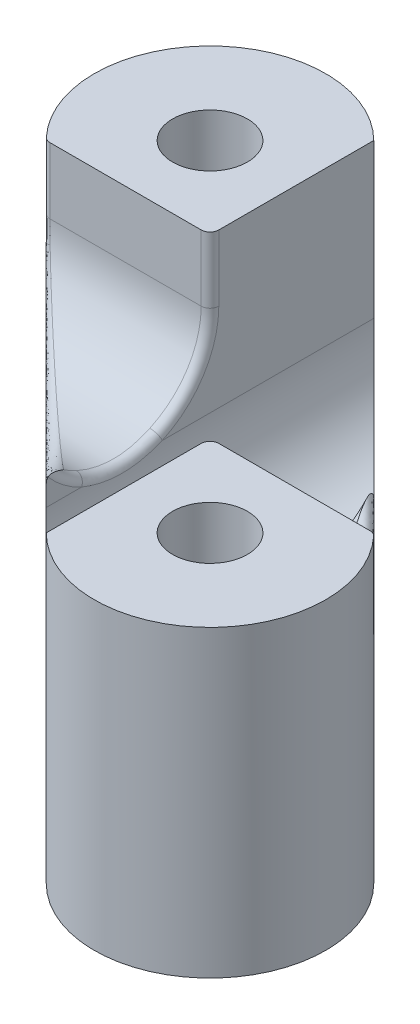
from build123d import *

# Parameters (mm, degrees)
SKETCH_1_R               = 5.260874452
SKETCH_1_R_2             = 1.7
EXTRUDE_1_DEPTH          = 13.8
CUT_EXTRUDE_1_DEPTH      = 23.966196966
CUT_EXTRUDE_1_DEPTH_BACK = 23.966196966
CUT_EXTRUDE_2_DEPTH      = 23.966196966
CUT_EXTRUDE_2_DEPTH_BACK = 23.966196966
SKETCH_3_R               = 4
FILLET_1_R               = 0.4


with BuildPart() as part:
    # Sketch 1 → Extrude 1 (new body)
    # profile 1 of 3: a face of its own
    with BuildSketch(Plane(origin=(0, 0, 0), x_dir=(1, 0, 0), z_dir=(0, 1, 0))):
        with BuildLine():
            Line((11.44, -4), (-4, 11.44))
            ThreePointArc((-4, 11.44), (-2.859585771, 9.733249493), (-2.459125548, 7.72))
            ThreePointArc((-2.459125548, 7.72), (-5.706750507, 2.859585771), (-11.44, 4))
            Line((-11.44, 4), (4, -11.44))
            ThreePointArc((4, -11.44), (4, -4), (11.44, -4))
        make_face()
    # profile 2 of 3: a face of its own
    with BuildSketch(Plane(origin=(0, 0, 0), x_dir=(1, 0, 0), z_dir=(0, 1, 0))):
        with Locations((7.72, -7.72)):
            Circle(SKETCH_1_R)
        with Locations(Location((7.72, -7.72, 0), (0, 0, 90))):
            Circle(SKETCH_1_R_2, mode=Mode.SUBTRACT)
    # profile 3 of 3: a face of its own
    with BuildSketch(Plane(origin=(0, 0, 0), x_dir=(1, 0, 0), z_dir=(0, 1, 0))):
        with Locations((-7.72, 7.72)):
            Circle(SKETCH_1_R)
        with Locations(Location((-7.72, 7.72, 0), (0, 0, 90))):
            Circle(SKETCH_1_R_2, mode=Mode.SUBTRACT)
    extrude(amount=EXTRUDE_1_DEPTH)

    # Sketch 2 → Cut-Extrude 1 (cut, two sides: drawn at the far end of the back side and taken through both)
    with BuildSketch(Plane.XY.offset(-CUT_EXTRUDE_1_DEPTH_BACK)):
        with BuildLine():
            Line((-4, 6.8), (-4, 21.404503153))
            Line((-4, 21.404503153), (4, 21.404503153))
            Line((4, 21.404503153), (4, 6.8))
            ThreePointArc((4, 6.8), (0, 2.8), (-4, 6.8))
        make_face()
    extrude(amount=CUT_EXTRUDE_1_DEPTH + CUT_EXTRUDE_1_DEPTH_BACK, mode=Mode.SUBTRACT)

    # Sketch 3 → Cut-Extrude 2 (cut, two sides: drawn at the far end of the back side and taken through both)
    with BuildSketch(Plane(origin=(0, 0, 0), x_dir=(0, 0, -1), z_dir=(1, 0, 0)).offset(-CUT_EXTRUDE_2_DEPTH_BACK)):
        with Locations((0, 10.8)):
            Circle(SKETCH_3_R)
        with BuildLine():
            Line((4, 10.8), (4, 16.218176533))
            Line((4, 16.218176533), (0, 16.218176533))
            Line((0, 16.218176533), (-4, 16.218176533))
            Line((-4, 16.218176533), (-4, 10.8))
            ThreePointArc((-4, 10.8), (0, 14.8), (4, 10.8))
        make_face()
    extrude(amount=CUT_EXTRUDE_2_DEPTH + CUT_EXTRUDE_2_DEPTH_BACK, mode=Mode.SUBTRACT)

    # Fillet 1
    fillet_1_edges = [part.edges().sort_by_distance(p)[0] for p in [
        (4, 12.3, 4),
        (4, 7.971572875, 2.828427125),
        (11.44, 12.3, 4),
        (-4, 12.3, -4),
        (-4, 7.971572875, -2.828427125),
        (-11.44, 12.3, -4),
        (4, 7.324032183, -1.979304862),
        (8.227685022, 6.878322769, 0.787685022),
        (-4, 7.324032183, 1.979304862),
        (-8.227685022, 6.878322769, -0.787685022),
    ]]
    fillet(fillet_1_edges, radius=FILLET_1_R)


solid = part.part
